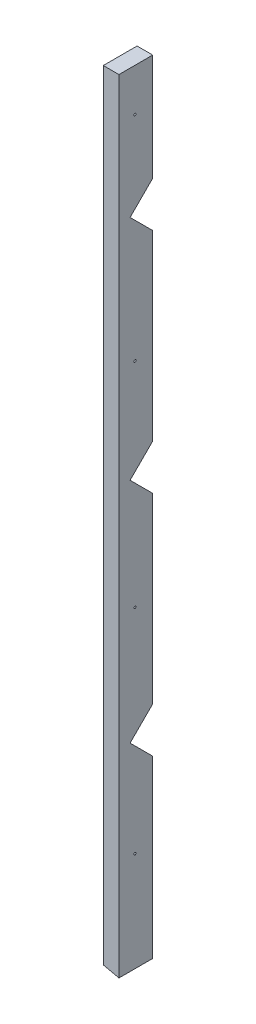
ISO-10303-21;
HEADER;
FILE_DESCRIPTION(('STEP AP214'),'2;1');
FILE_NAME('part.step','',(''),(''),'','','');
FILE_SCHEMA(('AUTOMOTIVE_DESIGN { 1 0 10303 214 1 1 1 1 }'));
ENDSEC;
DATA;
#1=APPLICATION_CONTEXT('core data for automotive mechanical design processes');
#2=APPLICATION_PROTOCOL_DEFINITION('international standard','automotive_design',2000,#1);
#3=PRODUCT_CONTEXT('',#1,'mechanical');
#4=PRODUCT('Part','Part','',(#3));
#5=PRODUCT_RELATED_PRODUCT_CATEGORY('part','',(#4));
#6=PRODUCT_DEFINITION_FORMATION('','',#4);
#7=PRODUCT_DEFINITION_CONTEXT('part definition',#1,'design');
#8=PRODUCT_DEFINITION('design','',#6,#7);
#9=PRODUCT_DEFINITION_SHAPE('','',#8);
#10=(LENGTH_UNIT() NAMED_UNIT(*) SI_UNIT(.MILLI.,.METRE.));
#11=(NAMED_UNIT(*) PLANE_ANGLE_UNIT() SI_UNIT($,.RADIAN.));
#12=(NAMED_UNIT(*) SI_UNIT($,.STERADIAN.) SOLID_ANGLE_UNIT());
#13=UNCERTAINTY_MEASURE_WITH_UNIT(LENGTH_MEASURE(1.E-05),#10,'distance_accuracy_value','');
#14=(GEOMETRIC_REPRESENTATION_CONTEXT(3) GLOBAL_UNCERTAINTY_ASSIGNED_CONTEXT((#13)) GLOBAL_UNIT_ASSIGNED_CONTEXT((#10,
#11,#12)) REPRESENTATION_CONTEXT('',''));
#15=CARTESIAN_POINT('',(0.,0.,0.));
#16=DIRECTION('',(0.,0.,1.));
#17=DIRECTION('',(1.,0.,0.));
#18=AXIS2_PLACEMENT_3D('',#15,#16,#17);
#19=CARTESIAN_POINT('',(22.,1100.,47.5));
#20=DIRECTION('',(-1.,0.,0.));
#21=DIRECTION('',(0.,0.,1.));
#22=AXIS2_PLACEMENT_3D('',#19,#20,#21);
#23=PLANE('',#22);
#24=CARTESIAN_POINT('',(22.,440.,25.));
#25=DIRECTION('',(-1.,0.,0.));
#26=DIRECTION('',(0.,0.,1.));
#27=AXIS2_PLACEMENT_3D('',#24,#25,#26);
#28=CIRCLE('',#27,1.49999999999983);
#29=CARTESIAN_POINT('',(22.,440.,26.4999999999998));
#30=VERTEX_POINT('',#29);
#31=EDGE_CURVE('E291',#30,#30,#28,.T.);
#32=ORIENTED_EDGE('',*,*,#31,.T.);
#33=EDGE_LOOP('',(#32));
#34=FACE_BOUND('',#33,.T.);
#35=DIRECTION('',(0.,-0.707106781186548,0.707106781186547));
#36=VECTOR('',#35,1.);
#37=CARTESIAN_POINT('',(22.,310.,0.));
#38=LINE('',#37,#36);
#39=CARTESIAN_POINT('',(22.,310.,0.));
#40=VERTEX_POINT('',#39);
#41=CARTESIAN_POINT('',(22.,278.180194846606,31.8198051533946));
#42=VERTEX_POINT('',#41);
#43=EDGE_CURVE('E132',#40,#42,#38,.T.);
#44=ORIENTED_EDGE('',*,*,#43,.F.);
#45=DIRECTION('',(0.,-1.,0.));
#46=VECTOR('',#45,1.);
#47=CARTESIAN_POINT('',(22.,1100.,0.));
#48=LINE('',#47,#46);
#49=CARTESIAN_POINT('',(22.,566.360389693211,0.));
#50=VERTEX_POINT('',#49);
#51=EDGE_CURVE('E225',#50,#40,#48,.T.);
#52=ORIENTED_EDGE('',*,*,#51,.F.);
#53=DIRECTION('',(0.,-0.707106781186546,-0.707106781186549));
#54=VECTOR('',#53,1.);
#55=CARTESIAN_POINT('',(22.,598.180194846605,31.8198051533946));
#56=LINE('',#55,#54);
#57=CARTESIAN_POINT('',(22.,598.180194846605,31.8198051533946));
#58=VERTEX_POINT('',#57);
#59=EDGE_CURVE('E161',#58,#50,#56,.T.);
#60=ORIENTED_EDGE('',*,*,#59,.F.);
#61=DIRECTION('',(0.,-0.707106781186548,0.707106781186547));
#62=VECTOR('',#61,1.);
#63=CARTESIAN_POINT('',(22.,630.,0.));
#64=LINE('',#63,#62);
#65=CARTESIAN_POINT('',(22.,630.,0.));
#66=VERTEX_POINT('',#65);
#67=EDGE_CURVE('E159',#66,#58,#64,.T.);
#68=ORIENTED_EDGE('',*,*,#67,.F.);
#69=CARTESIAN_POINT('',(22.,886.360389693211,0.));
#70=VERTEX_POINT('',#69);
#71=EDGE_CURVE('E34',#70,#66,#48,.T.);
#72=ORIENTED_EDGE('',*,*,#71,.F.);
#73=DIRECTION('',(0.,-0.707106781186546,-0.707106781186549));
#74=VECTOR('',#73,1.);
#75=CARTESIAN_POINT('',(22.,918.180194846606,31.8198051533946));
#76=LINE('',#75,#74);
#77=CARTESIAN_POINT('',(22.,918.180194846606,31.8198051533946));
#78=VERTEX_POINT('',#77);
#79=EDGE_CURVE('E192',#78,#70,#76,.T.);
#80=ORIENTED_EDGE('',*,*,#79,.F.);
#81=DIRECTION('',(0.,-0.707106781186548,0.707106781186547));
#82=VECTOR('',#81,1.);
#83=CARTESIAN_POINT('',(22.,950.,0.));
#84=LINE('',#83,#82);
#85=CARTESIAN_POINT('',(22.,950.,0.));
#86=VERTEX_POINT('',#85);
#87=EDGE_CURVE('E190',#86,#78,#84,.T.);
#88=ORIENTED_EDGE('',*,*,#87,.F.);
#89=CARTESIAN_POINT('',(22.,1100.,0.));
#90=VERTEX_POINT('',#89);
#91=EDGE_CURVE('E11',#90,#86,#48,.T.);
#92=ORIENTED_EDGE('',*,*,#91,.F.);
#93=DIRECTION('',(0.,0.,-1.));
#94=VECTOR('',#93,1.);
#95=CARTESIAN_POINT('',(22.,1100.,47.5));
#96=LINE('',#95,#94);
#97=CARTESIAN_POINT('',(22.,1100.,47.5));
#98=VERTEX_POINT('',#97);
#99=EDGE_CURVE('E205',#98,#90,#96,.T.);
#100=ORIENTED_EDGE('',*,*,#99,.F.);
#101=DIRECTION('',(0.,-1.,0.));
#102=VECTOR('',#101,1.);
#103=CARTESIAN_POINT('',(22.,1100.,47.5));
#104=LINE('',#103,#102);
#105=CARTESIAN_POINT('',(22.,0.,47.5000000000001));
#106=VERTEX_POINT('',#105);
#107=EDGE_CURVE('E214',#98,#106,#104,.T.);
#108=ORIENTED_EDGE('',*,*,#107,.T.);
#109=DIRECTION('',(0.,0.,-1.));
#110=VECTOR('',#109,1.);
#111=CARTESIAN_POINT('',(22.,0.,47.5));
#112=LINE('',#111,#110);
#113=CARTESIAN_POINT('',(22.,0.,0.));
#114=VERTEX_POINT('',#113);
#115=EDGE_CURVE('E202',#106,#114,#112,.T.);
#116=ORIENTED_EDGE('',*,*,#115,.T.);
#117=CARTESIAN_POINT('',(22.,246.360389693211,0.));
#118=VERTEX_POINT('',#117);
#119=EDGE_CURVE('E35',#118,#114,#48,.T.);
#120=ORIENTED_EDGE('',*,*,#119,.F.);
#121=DIRECTION('',(0.,-0.707106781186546,-0.707106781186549));
#122=VECTOR('',#121,1.);
#123=CARTESIAN_POINT('',(22.,278.180194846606,31.8198051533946));
#124=LINE('',#123,#122);
#125=EDGE_CURVE('E151',#42,#118,#124,.T.);
#126=ORIENTED_EDGE('',*,*,#125,.F.);
#127=EDGE_LOOP('',(#44,#52,#60,#68,#72,#80,#88,#92,#100,#108,#116,#120,#126));
#128=FACE_BOUND('',#127,.T.);
#129=CARTESIAN_POINT('',(22.,1040.,25.));
#130=DIRECTION('',(-1.,0.,0.));
#131=DIRECTION('',(0.,0.,1.));
#132=AXIS2_PLACEMENT_3D('',#129,#130,#131);
#133=CIRCLE('',#132,1.49999999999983);
#134=CARTESIAN_POINT('',(22.,1040.,26.4999999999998));
#135=VERTEX_POINT('',#134);
#136=EDGE_CURVE('E178',#135,#135,#133,.T.);
#137=ORIENTED_EDGE('',*,*,#136,.T.);
#138=EDGE_LOOP('',(#137));
#139=FACE_BOUND('',#138,.T.);
#140=CARTESIAN_POINT('',(22.,740.,25.));
#141=DIRECTION('',(-1.,0.,0.));
#142=DIRECTION('',(0.,0.,1.));
#143=AXIS2_PLACEMENT_3D('',#140,#141,#142);
#144=CIRCLE('',#143,1.49999999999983);
#145=CARTESIAN_POINT('',(22.,740.,26.4999999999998));
#146=VERTEX_POINT('',#145);
#147=EDGE_CURVE('E146',#146,#146,#144,.T.);
#148=ORIENTED_EDGE('',*,*,#147,.T.);
#149=EDGE_LOOP('',(#148));
#150=FACE_BOUND('',#149,.T.);
#151=CARTESIAN_POINT('',(22.,140.,25.));
#152=DIRECTION('',(-1.,0.,0.));
#153=DIRECTION('',(0.,0.,1.));
#154=AXIS2_PLACEMENT_3D('',#151,#152,#153);
#155=CIRCLE('',#154,1.49999999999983);
#156=CARTESIAN_POINT('',(22.,140.,26.4999999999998));
#157=VERTEX_POINT('',#156);
#158=EDGE_CURVE('E299',#157,#157,#155,.T.);
#159=ORIENTED_EDGE('',*,*,#158,.T.);
#160=EDGE_LOOP('',(#159));
#161=FACE_BOUND('',#160,.T.);
#162=ADVANCED_FACE('F27',(#34,#128,#139,#150,#161),#23,.F.);
#163=CARTESIAN_POINT('',(0.,1100.,47.5));
#164=DIRECTION('',(1.,0.,0.));
#165=DIRECTION('',(0.,0.,-1.));
#166=AXIS2_PLACEMENT_3D('',#163,#164,#165);
#167=PLANE('',#166);
#168=CARTESIAN_POINT('',(0.,440.,25.));
#169=DIRECTION('',(1.,0.,0.));
#170=DIRECTION('',(0.,0.,-1.));
#171=AXIS2_PLACEMENT_3D('',#168,#169,#170);
#172=CIRCLE('',#171,1.49999999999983);
#173=CARTESIAN_POINT('',(0.,440.,23.5000000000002));
#174=VERTEX_POINT('',#173);
#175=EDGE_CURVE('E293',#174,#174,#172,.T.);
#176=ORIENTED_EDGE('',*,*,#175,.T.);
#177=EDGE_LOOP('',(#176));
#178=FACE_BOUND('',#177,.T.);
#179=DIRECTION('',(0.,-0.707106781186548,0.707106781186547));
#180=VECTOR('',#179,1.);
#181=CARTESIAN_POINT('',(0.,310.,0.));
#182=LINE('',#181,#180);
#183=CARTESIAN_POINT('',(0.,310.,0.));
#184=VERTEX_POINT('',#183);
#185=CARTESIAN_POINT('',(0.,278.180194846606,31.8198051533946));
#186=VERTEX_POINT('',#185);
#187=EDGE_CURVE('E42',#184,#186,#182,.T.);
#188=ORIENTED_EDGE('',*,*,#187,.T.);
#189=DIRECTION('',(0.,-0.707106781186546,-0.707106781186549));
#190=VECTOR('',#189,1.);
#191=CARTESIAN_POINT('',(0.,278.180194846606,31.8198051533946));
#192=LINE('',#191,#190);
#193=CARTESIAN_POINT('',(0.,246.360389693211,0.));
#194=VERTEX_POINT('',#193);
#195=EDGE_CURVE('E124',#186,#194,#192,.T.);
#196=ORIENTED_EDGE('',*,*,#195,.T.);
#197=DIRECTION('',(0.,-1.,0.));
#198=VECTOR('',#197,1.);
#199=CARTESIAN_POINT('',(0.,1100.,0.));
#200=LINE('',#199,#198);
#201=CARTESIAN_POINT('',(0.,5.,0.));
#202=VERTEX_POINT('',#201);
#203=EDGE_CURVE('E219',#194,#202,#200,.T.);
#204=ORIENTED_EDGE('',*,*,#203,.T.);
#205=DIRECTION('',(0.,0.,-1.));
#206=VECTOR('',#205,1.);
#207=CARTESIAN_POINT('',(0.,5.,1376.55607972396));
#208=LINE('',#207,#206);
#209=CARTESIAN_POINT('',(0.,5.,47.5000000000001));
#210=VERTEX_POINT('',#209);
#211=EDGE_CURVE('E169',#210,#202,#208,.T.);
#212=ORIENTED_EDGE('',*,*,#211,.F.);
#213=DIRECTION('',(0.,-1.,0.));
#214=VECTOR('',#213,1.);
#215=CARTESIAN_POINT('',(0.,1100.,47.5));
#216=LINE('',#215,#214);
#217=CARTESIAN_POINT('',(0.,1100.,47.5));
#218=VERTEX_POINT('',#217);
#219=EDGE_CURVE('E217',#218,#210,#216,.T.);
#220=ORIENTED_EDGE('',*,*,#219,.F.);
#221=DIRECTION('',(0.,0.,1.));
#222=VECTOR('',#221,1.);
#223=CARTESIAN_POINT('',(0.,1100.,47.5));
#224=LINE('',#223,#222);
#225=CARTESIAN_POINT('',(0.,1100.,0.));
#226=VERTEX_POINT('',#225);
#227=EDGE_CURVE('E210',#226,#218,#224,.T.);
#228=ORIENTED_EDGE('',*,*,#227,.F.);
#229=CARTESIAN_POINT('',(0.,950.,0.));
#230=VERTEX_POINT('',#229);
#231=EDGE_CURVE('E220',#226,#230,#200,.T.);
#232=ORIENTED_EDGE('',*,*,#231,.T.);
#233=DIRECTION('',(0.,-0.707106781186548,0.707106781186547));
#234=VECTOR('',#233,1.);
#235=CARTESIAN_POINT('',(0.,950.,0.));
#236=LINE('',#235,#234);
#237=CARTESIAN_POINT('',(0.,918.180194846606,31.8198051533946));
#238=VERTEX_POINT('',#237);
#239=EDGE_CURVE('E182',#230,#238,#236,.T.);
#240=ORIENTED_EDGE('',*,*,#239,.T.);
#241=DIRECTION('',(0.,-0.707106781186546,-0.707106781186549));
#242=VECTOR('',#241,1.);
#243=CARTESIAN_POINT('',(0.,918.180194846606,31.8198051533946));
#244=LINE('',#243,#242);
#245=CARTESIAN_POINT('',(0.,886.360389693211,0.));
#246=VERTEX_POINT('',#245);
#247=EDGE_CURVE('E187',#238,#246,#244,.T.);
#248=ORIENTED_EDGE('',*,*,#247,.T.);
#249=CARTESIAN_POINT('',(0.,630.,0.));
#250=VERTEX_POINT('',#249);
#251=EDGE_CURVE('E222',#246,#250,#200,.T.);
#252=ORIENTED_EDGE('',*,*,#251,.T.);
#253=DIRECTION('',(0.,-0.707106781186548,0.707106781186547));
#254=VECTOR('',#253,1.);
#255=CARTESIAN_POINT('',(0.,630.,0.));
#256=LINE('',#255,#254);
#257=CARTESIAN_POINT('',(0.,598.180194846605,31.8198051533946));
#258=VERTEX_POINT('',#257);
#259=EDGE_CURVE('E50',#250,#258,#256,.T.);
#260=ORIENTED_EDGE('',*,*,#259,.T.);
#261=DIRECTION('',(0.,-0.707106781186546,-0.707106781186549));
#262=VECTOR('',#261,1.);
#263=CARTESIAN_POINT('',(0.,598.180194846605,31.8198051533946));
#264=LINE('',#263,#262);
#265=CARTESIAN_POINT('',(0.,566.360389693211,0.));
#266=VERTEX_POINT('',#265);
#267=EDGE_CURVE('E157',#258,#266,#264,.T.);
#268=ORIENTED_EDGE('',*,*,#267,.T.);
#269=EDGE_CURVE('E142',#266,#184,#200,.T.);
#270=ORIENTED_EDGE('',*,*,#269,.T.);
#271=EDGE_LOOP('',(#188,#196,#204,#212,#220,#228,#232,#240,#248,#252,#260,#268,#270));
#272=FACE_BOUND('',#271,.T.);
#273=CARTESIAN_POINT('',(0.,1040.,25.));
#274=DIRECTION('',(1.,0.,0.));
#275=DIRECTION('',(0.,0.,-1.));
#276=AXIS2_PLACEMENT_3D('',#273,#274,#275);
#277=CIRCLE('',#276,1.49999999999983);
#278=CARTESIAN_POINT('',(0.,1040.,23.5000000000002));
#279=VERTEX_POINT('',#278);
#280=EDGE_CURVE('E179',#279,#279,#277,.T.);
#281=ORIENTED_EDGE('',*,*,#280,.T.);
#282=EDGE_LOOP('',(#281));
#283=FACE_BOUND('',#282,.T.);
#284=CARTESIAN_POINT('',(0.,740.,25.));
#285=DIRECTION('',(1.,0.,0.));
#286=DIRECTION('',(0.,0.,-1.));
#287=AXIS2_PLACEMENT_3D('',#284,#285,#286);
#288=CIRCLE('',#287,1.49999999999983);
#289=CARTESIAN_POINT('',(0.,740.,23.5000000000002));
#290=VERTEX_POINT('',#289);
#291=EDGE_CURVE('E143',#290,#290,#288,.T.);
#292=ORIENTED_EDGE('',*,*,#291,.T.);
#293=EDGE_LOOP('',(#292));
#294=FACE_BOUND('',#293,.T.);
#295=CARTESIAN_POINT('',(0.,140.,25.));
#296=DIRECTION('',(1.,0.,0.));
#297=DIRECTION('',(0.,0.,-1.));
#298=AXIS2_PLACEMENT_3D('',#295,#296,#297);
#299=CIRCLE('',#298,1.49999999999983);
#300=CARTESIAN_POINT('',(0.,140.,23.5000000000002));
#301=VERTEX_POINT('',#300);
#302=EDGE_CURVE('E294',#301,#301,#299,.T.);
#303=ORIENTED_EDGE('',*,*,#302,.T.);
#304=EDGE_LOOP('',(#303));
#305=FACE_BOUND('',#304,.T.);
#306=ADVANCED_FACE('F138',(#178,#272,#283,#294,#305),#167,.F.);
#307=CARTESIAN_POINT('',(22.,1100.,0.));
#308=DIRECTION('',(0.,0.,1.));
#309=DIRECTION('',(1.,0.,0.));
#310=AXIS2_PLACEMENT_3D('',#307,#308,#309);
#311=PLANE('',#310);
#312=DIRECTION('',(-1.,0.,0.));
#313=VECTOR('',#312,1.);
#314=CARTESIAN_POINT('',(22.,246.360389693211,0.));
#315=LINE('',#314,#313);
#316=EDGE_CURVE('E129',#118,#194,#315,.T.);
#317=ORIENTED_EDGE('',*,*,#316,.F.);
#318=ORIENTED_EDGE('',*,*,#119,.T.);
#319=DIRECTION('',(-0.97513285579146,0.221621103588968,0.));
#320=VECTOR('',#319,1.);
#321=CARTESIAN_POINT('',(-215.721021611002,54.027504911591,0.));
#322=LINE('',#321,#320);
#323=EDGE_CURVE('E175',#114,#202,#322,.T.);
#324=ORIENTED_EDGE('',*,*,#323,.T.);
#325=ORIENTED_EDGE('',*,*,#203,.F.);
#326=EDGE_LOOP('',(#317,#318,#324,#325));
#327=FACE_BOUND('',#326,.T.);
#328=ADVANCED_FACE('F233',(#327),#311,.F.);
#329=DIRECTION('',(-1.,0.,0.));
#330=VECTOR('',#329,1.);
#331=CARTESIAN_POINT('',(22.,310.,0.));
#332=LINE('',#331,#330);
#333=EDGE_CURVE('E153',#40,#184,#332,.T.);
#334=ORIENTED_EDGE('',*,*,#333,.T.);
#335=ORIENTED_EDGE('',*,*,#269,.F.);
#336=DIRECTION('',(-1.,0.,0.));
#337=VECTOR('',#336,1.);
#338=CARTESIAN_POINT('',(22.,566.360389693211,0.));
#339=LINE('',#338,#337);
#340=EDGE_CURVE('E165',#50,#266,#339,.T.);
#341=ORIENTED_EDGE('',*,*,#340,.F.);
#342=ORIENTED_EDGE('',*,*,#51,.T.);
#343=EDGE_LOOP('',(#334,#335,#341,#342));
#344=FACE_BOUND('',#343,.T.);
#345=ADVANCED_FACE('F265',(#344),#311,.F.);
#346=DIRECTION('',(-1.,0.,0.));
#347=VECTOR('',#346,1.);
#348=CARTESIAN_POINT('',(22.,630.,0.));
#349=LINE('',#348,#347);
#350=EDGE_CURVE('E163',#66,#250,#349,.T.);
#351=ORIENTED_EDGE('',*,*,#350,.T.);
#352=ORIENTED_EDGE('',*,*,#251,.F.);
#353=DIRECTION('',(-1.,0.,0.));
#354=VECTOR('',#353,1.);
#355=CARTESIAN_POINT('',(22.,886.360389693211,0.));
#356=LINE('',#355,#354);
#357=EDGE_CURVE('E197',#70,#246,#356,.T.);
#358=ORIENTED_EDGE('',*,*,#357,.F.);
#359=ORIENTED_EDGE('',*,*,#71,.T.);
#360=EDGE_LOOP('',(#351,#352,#358,#359));
#361=FACE_BOUND('',#360,.T.);
#362=ADVANCED_FACE('F260',(#361),#311,.F.);
#363=DIRECTION('',(-1.,0.,0.));
#364=VECTOR('',#363,1.);
#365=CARTESIAN_POINT('',(22.,950.,0.));
#366=LINE('',#365,#364);
#367=EDGE_CURVE('E194',#86,#230,#366,.T.);
#368=ORIENTED_EDGE('',*,*,#367,.T.);
#369=ORIENTED_EDGE('',*,*,#231,.F.);
#370=DIRECTION('',(-1.,0.,0.));
#371=VECTOR('',#370,1.);
#372=CARTESIAN_POINT('',(22.,1100.,0.));
#373=LINE('',#372,#371);
#374=EDGE_CURVE('E208',#90,#226,#373,.T.);
#375=ORIENTED_EDGE('',*,*,#374,.F.);
#376=ORIENTED_EDGE('',*,*,#91,.T.);
#377=EDGE_LOOP('',(#368,#369,#375,#376));
#378=FACE_BOUND('',#377,.T.);
#379=ADVANCED_FACE('F246',(#378),#311,.F.);
#380=CARTESIAN_POINT('',(22.,1100.,47.5));
#381=DIRECTION('',(0.,0.,-1.));
#382=DIRECTION('',(-1.,0.,0.));
#383=AXIS2_PLACEMENT_3D('',#380,#381,#382);
#384=PLANE('',#383);
#385=ORIENTED_EDGE('',*,*,#219,.T.);
#386=DIRECTION('',(0.97513285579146,-0.221621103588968,0.));
#387=VECTOR('',#386,1.);
#388=CARTESIAN_POINT('',(-215.721021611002,54.027504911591,47.5));
#389=LINE('',#388,#387);
#390=EDGE_CURVE('E172',#210,#106,#389,.T.);
#391=ORIENTED_EDGE('',*,*,#390,.T.);
#392=ORIENTED_EDGE('',*,*,#107,.F.);
#393=DIRECTION('',(1.,0.,0.));
#394=VECTOR('',#393,1.);
#395=CARTESIAN_POINT('',(22.,1100.,47.5));
#396=LINE('',#395,#394);
#397=EDGE_CURVE('E212',#218,#98,#396,.T.);
#398=ORIENTED_EDGE('',*,*,#397,.F.);
#399=EDGE_LOOP('',(#385,#391,#392,#398));
#400=FACE_BOUND('',#399,.T.);
#401=ADVANCED_FACE('F240',(#400),#384,.F.);
#402=CARTESIAN_POINT('',(22.,1100.,47.5));
#403=DIRECTION('',(0.,1.,0.));
#404=DIRECTION('',(0.,0.,1.));
#405=AXIS2_PLACEMENT_3D('',#402,#403,#404);
#406=PLANE('',#405);
#407=ORIENTED_EDGE('',*,*,#99,.T.);
#408=ORIENTED_EDGE('',*,*,#374,.T.);
#409=ORIENTED_EDGE('',*,*,#227,.T.);
#410=ORIENTED_EDGE('',*,*,#397,.T.);
#411=EDGE_LOOP('',(#407,#408,#409,#410));
#412=FACE_BOUND('',#411,.T.);
#413=ADVANCED_FACE('F243',(#412),#406,.T.);
#414=CARTESIAN_POINT('',(22.,950.,0.));
#415=DIRECTION('',(0.,-0.707106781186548,-0.707106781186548));
#416=DIRECTION('',(0.,0.707106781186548,-0.707106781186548));
#417=AXIS2_PLACEMENT_3D('',#414,#415,#416);
#418=PLANE('',#417);
#419=ORIENTED_EDGE('',*,*,#239,.F.);
#420=ORIENTED_EDGE('',*,*,#367,.F.);
#421=ORIENTED_EDGE('',*,*,#87,.T.);
#422=DIRECTION('',(-1.,0.,0.));
#423=VECTOR('',#422,1.);
#424=CARTESIAN_POINT('',(22.,918.180194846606,31.8198051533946));
#425=LINE('',#424,#423);
#426=EDGE_CURVE('E199',#78,#238,#425,.T.);
#427=ORIENTED_EDGE('',*,*,#426,.T.);
#428=EDGE_LOOP('',(#419,#420,#421,#427));
#429=FACE_BOUND('',#428,.T.);
#430=ADVANCED_FACE('F249',(#429),#418,.T.);
#431=CARTESIAN_POINT('',(22.,918.180194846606,31.8198051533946));
#432=DIRECTION('',(0.,0.707106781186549,-0.707106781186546));
#433=DIRECTION('',(0.,0.707106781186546,0.707106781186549));
#434=AXIS2_PLACEMENT_3D('',#431,#432,#433);
#435=PLANE('',#434);
#436=ORIENTED_EDGE('',*,*,#247,.F.);
#437=ORIENTED_EDGE('',*,*,#426,.F.);
#438=ORIENTED_EDGE('',*,*,#79,.T.);
#439=ORIENTED_EDGE('',*,*,#357,.T.);
#440=EDGE_LOOP('',(#436,#437,#438,#439));
#441=FACE_BOUND('',#440,.T.);
#442=ADVANCED_FACE('F257',(#441),#435,.T.);
#443=CARTESIAN_POINT('',(22.001,1040.,25.));
#444=DIRECTION('',(-1.,0.,0.));
#445=DIRECTION('',(0.,0.,1.));
#446=AXIS2_PLACEMENT_3D('',#443,#444,#445);
#447=CYLINDRICAL_SURFACE('',#446,1.49999999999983);
#448=ORIENTED_EDGE('',*,*,#280,.F.);
#449=EDGE_LOOP('',(#448));
#450=FACE_BOUND('',#449,.T.);
#451=ORIENTED_EDGE('',*,*,#136,.F.);
#452=EDGE_LOOP('',(#451));
#453=FACE_BOUND('',#452,.T.);
#454=ADVANCED_FACE('F279',(#450,#453),#447,.F.);
#455=CARTESIAN_POINT('',(0.,5.,1376.55607972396));
#456=DIRECTION('',(0.221621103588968,0.97513285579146,0.));
#457=DIRECTION('',(-0.97513285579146,0.221621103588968,0.));
#458=AXIS2_PLACEMENT_3D('',#455,#456,#457);
#459=PLANE('',#458);
#460=ORIENTED_EDGE('',*,*,#323,.F.);
#461=ORIENTED_EDGE('',*,*,#115,.F.);
#462=ORIENTED_EDGE('',*,*,#390,.F.);
#463=ORIENTED_EDGE('',*,*,#211,.T.);
#464=EDGE_LOOP('',(#460,#461,#462,#463));
#465=FACE_BOUND('',#464,.T.);
#466=ADVANCED_FACE('F232',(#465),#459,.F.);
#467=CARTESIAN_POINT('',(22.,630.,0.));
#468=DIRECTION('',(0.,-0.707106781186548,-0.707106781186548));
#469=DIRECTION('',(0.,0.707106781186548,-0.707106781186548));
#470=AXIS2_PLACEMENT_3D('',#467,#468,#469);
#471=PLANE('',#470);
#472=ORIENTED_EDGE('',*,*,#259,.F.);
#473=ORIENTED_EDGE('',*,*,#350,.F.);
#474=ORIENTED_EDGE('',*,*,#67,.T.);
#475=DIRECTION('',(-1.,0.,0.));
#476=VECTOR('',#475,1.);
#477=CARTESIAN_POINT('',(22.,598.180194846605,31.8198051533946));
#478=LINE('',#477,#476);
#479=EDGE_CURVE('E167',#58,#258,#478,.T.);
#480=ORIENTED_EDGE('',*,*,#479,.T.);
#481=EDGE_LOOP('',(#472,#473,#474,#480));
#482=FACE_BOUND('',#481,.T.);
#483=ADVANCED_FACE('F270',(#482),#471,.T.);
#484=CARTESIAN_POINT('',(22.,598.180194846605,31.8198051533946));
#485=DIRECTION('',(0.,0.707106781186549,-0.707106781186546));
#486=DIRECTION('',(0.,0.707106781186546,0.707106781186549));
#487=AXIS2_PLACEMENT_3D('',#484,#485,#486);
#488=PLANE('',#487);
#489=ORIENTED_EDGE('',*,*,#267,.F.);
#490=ORIENTED_EDGE('',*,*,#479,.F.);
#491=ORIENTED_EDGE('',*,*,#59,.T.);
#492=ORIENTED_EDGE('',*,*,#340,.T.);
#493=EDGE_LOOP('',(#489,#490,#491,#492));
#494=FACE_BOUND('',#493,.T.);
#495=ADVANCED_FACE('F269',(#494),#488,.T.);
#496=CARTESIAN_POINT('',(22.,310.,0.));
#497=DIRECTION('',(0.,-0.707106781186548,-0.707106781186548));
#498=DIRECTION('',(0.,0.707106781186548,-0.707106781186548));
#499=AXIS2_PLACEMENT_3D('',#496,#497,#498);
#500=PLANE('',#499);
#501=ORIENTED_EDGE('',*,*,#187,.F.);
#502=ORIENTED_EDGE('',*,*,#333,.F.);
#503=ORIENTED_EDGE('',*,*,#43,.T.);
#504=DIRECTION('',(-1.,0.,0.));
#505=VECTOR('',#504,1.);
#506=CARTESIAN_POINT('',(22.,278.180194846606,31.8198051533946));
#507=LINE('',#506,#505);
#508=EDGE_CURVE('E126',#42,#186,#507,.T.);
#509=ORIENTED_EDGE('',*,*,#508,.T.);
#510=EDGE_LOOP('',(#501,#502,#503,#509));
#511=FACE_BOUND('',#510,.T.);
#512=ADVANCED_FACE('F134',(#511),#500,.T.);
#513=CARTESIAN_POINT('',(22.,278.180194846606,31.8198051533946));
#514=DIRECTION('',(0.,0.707106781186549,-0.707106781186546));
#515=DIRECTION('',(0.,0.707106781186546,0.707106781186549));
#516=AXIS2_PLACEMENT_3D('',#513,#514,#515);
#517=PLANE('',#516);
#518=ORIENTED_EDGE('',*,*,#195,.F.);
#519=ORIENTED_EDGE('',*,*,#508,.F.);
#520=ORIENTED_EDGE('',*,*,#125,.T.);
#521=ORIENTED_EDGE('',*,*,#316,.T.);
#522=EDGE_LOOP('',(#518,#519,#520,#521));
#523=FACE_BOUND('',#522,.T.);
#524=ADVANCED_FACE('F125',(#523),#517,.T.);
#525=CARTESIAN_POINT('',(22.001,740.,25.));
#526=DIRECTION('',(-1.,0.,0.));
#527=DIRECTION('',(0.,0.,1.));
#528=AXIS2_PLACEMENT_3D('',#525,#526,#527);
#529=CYLINDRICAL_SURFACE('',#528,1.49999999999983);
#530=ORIENTED_EDGE('',*,*,#291,.F.);
#531=EDGE_LOOP('',(#530));
#532=FACE_BOUND('',#531,.T.);
#533=ORIENTED_EDGE('',*,*,#147,.F.);
#534=EDGE_LOOP('',(#533));
#535=FACE_BOUND('',#534,.T.);
#536=ADVANCED_FACE('F314',(#532,#535),#529,.F.);
#537=CARTESIAN_POINT('',(22.001,440.,25.));
#538=DIRECTION('',(-1.,0.,0.));
#539=DIRECTION('',(0.,0.,1.));
#540=AXIS2_PLACEMENT_3D('',#537,#538,#539);
#541=CYLINDRICAL_SURFACE('',#540,1.49999999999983);
#542=ORIENTED_EDGE('',*,*,#175,.F.);
#543=EDGE_LOOP('',(#542));
#544=FACE_BOUND('',#543,.T.);
#545=ORIENTED_EDGE('',*,*,#31,.F.);
#546=EDGE_LOOP('',(#545));
#547=FACE_BOUND('',#546,.T.);
#548=ADVANCED_FACE('F308',(#544,#547),#541,.F.);
#549=CARTESIAN_POINT('',(22.001,140.,25.));
#550=DIRECTION('',(-1.,0.,0.));
#551=DIRECTION('',(0.,0.,1.));
#552=AXIS2_PLACEMENT_3D('',#549,#550,#551);
#553=CYLINDRICAL_SURFACE('',#552,1.49999999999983);
#554=ORIENTED_EDGE('',*,*,#302,.F.);
#555=EDGE_LOOP('',(#554));
#556=FACE_BOUND('',#555,.T.);
#557=ORIENTED_EDGE('',*,*,#158,.F.);
#558=EDGE_LOOP('',(#557));
#559=FACE_BOUND('',#558,.T.);
#560=ADVANCED_FACE('F306',(#556,#559),#553,.F.);
#561=CLOSED_SHELL('',(#162,#306,#328,#345,#362,#379,#401,#413,#430,#442,#454,#466,#483,#495,
#512,#524,#536,#548,#560));
#562=MANIFOLD_SOLID_BREP('B2',#561);
#563=ADVANCED_BREP_SHAPE_REPRESENTATION('',(#18,#562),#14);
#564=SHAPE_DEFINITION_REPRESENTATION(#9,#563);
ENDSEC;
END-ISO-10303-21;
